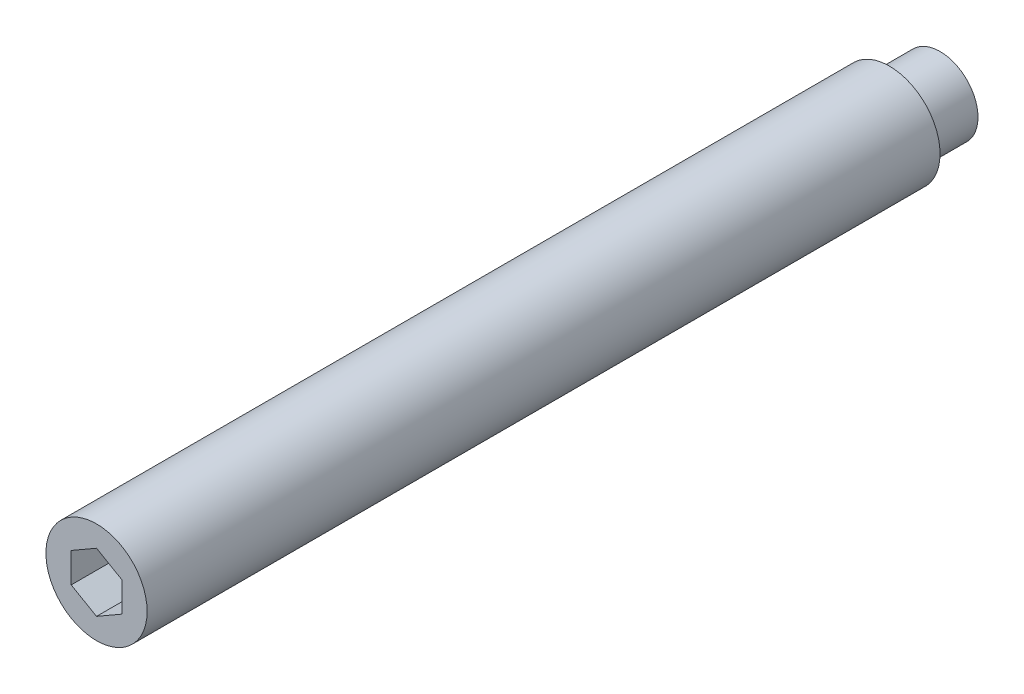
ISO-10303-21;
HEADER;
FILE_DESCRIPTION(('STEP AP214'),'2;1');
FILE_NAME('part.step','',(''),(''),'','','');
FILE_SCHEMA(('AUTOMOTIVE_DESIGN { 1 0 10303 214 1 1 1 1 }'));
ENDSEC;
DATA;
#1=APPLICATION_CONTEXT('core data for automotive mechanical design processes');
#2=APPLICATION_PROTOCOL_DEFINITION('international standard','automotive_design',2000,#1);
#3=PRODUCT_CONTEXT('',#1,'mechanical');
#4=PRODUCT('Part','Part','',(#3));
#5=PRODUCT_RELATED_PRODUCT_CATEGORY('part','',(#4));
#6=PRODUCT_DEFINITION_FORMATION('','',#4);
#7=PRODUCT_DEFINITION_CONTEXT('part definition',#1,'design');
#8=PRODUCT_DEFINITION('design','',#6,#7);
#9=PRODUCT_DEFINITION_SHAPE('','',#8);
#10=(LENGTH_UNIT() NAMED_UNIT(*) SI_UNIT(.MILLI.,.METRE.));
#11=(NAMED_UNIT(*) PLANE_ANGLE_UNIT() SI_UNIT($,.RADIAN.));
#12=(NAMED_UNIT(*) SI_UNIT($,.STERADIAN.) SOLID_ANGLE_UNIT());
#13=UNCERTAINTY_MEASURE_WITH_UNIT(LENGTH_MEASURE(1.E-05),#10,'distance_accuracy_value','');
#14=(GEOMETRIC_REPRESENTATION_CONTEXT(3) GLOBAL_UNCERTAINTY_ASSIGNED_CONTEXT((#13)) GLOBAL_UNIT_ASSIGNED_CONTEXT((#10,
#11,#12)) REPRESENTATION_CONTEXT('',''));
#15=CARTESIAN_POINT('',(0.,0.,0.));
#16=DIRECTION('',(0.,0.,1.));
#17=DIRECTION('',(1.,0.,0.));
#18=AXIS2_PLACEMENT_3D('',#15,#16,#17);
#19=CARTESIAN_POINT('',(0.,3.5,95.));
#20=DIRECTION('',(-0.5,-0.866025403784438,0.));
#21=DIRECTION('',(0.866025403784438,-0.5,0.));
#22=AXIS2_PLACEMENT_3D('',#19,#20,#21);
#23=PLANE('',#22);
#24=DIRECTION('',(0.,0.,1.));
#25=VECTOR('',#24,1.);
#26=CARTESIAN_POINT('',(3.,1.76794919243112,95.));
#27=LINE('',#26,#25);
#28=CARTESIAN_POINT('',(3.,1.76794919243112,95.));
#29=VERTEX_POINT('',#28);
#30=CARTESIAN_POINT('',(3.,1.76794919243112,100.));
#31=VERTEX_POINT('',#30);
#32=EDGE_CURVE('E37',#29,#31,#27,.T.);
#33=ORIENTED_EDGE('',*,*,#32,.T.);
#34=DIRECTION('',(0.866025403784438,-0.5,0.));
#35=VECTOR('',#34,1.);
#36=CARTESIAN_POINT('',(0.,3.5,100.));
#37=LINE('',#36,#35);
#38=CARTESIAN_POINT('',(0.,3.5,100.));
#39=VERTEX_POINT('',#38);
#40=EDGE_CURVE('E29',#39,#31,#37,.T.);
#41=ORIENTED_EDGE('',*,*,#40,.F.);
#42=DIRECTION('',(0.,0.,1.));
#43=VECTOR('',#42,1.);
#44=CARTESIAN_POINT('',(0.,3.5,95.));
#45=LINE('',#44,#43);
#46=CARTESIAN_POINT('',(0.,3.5,95.));
#47=VERTEX_POINT('',#46);
#48=EDGE_CURVE('E93',#47,#39,#45,.T.);
#49=ORIENTED_EDGE('',*,*,#48,.F.);
#50=DIRECTION('',(0.866025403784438,-0.5,0.));
#51=VECTOR('',#50,1.);
#52=CARTESIAN_POINT('',(0.,3.5,95.));
#53=LINE('',#52,#51);
#54=EDGE_CURVE('E96',#47,#29,#53,.T.);
#55=ORIENTED_EDGE('',*,*,#54,.T.);
#56=EDGE_LOOP('',(#33,#41,#49,#55));
#57=FACE_BOUND('',#56,.T.);
#58=ADVANCED_FACE('F14',(#57),#23,.T.);
#59=CARTESIAN_POINT('',(3.,1.76794919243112,95.));
#60=DIRECTION('',(-1.,0.,0.));
#61=DIRECTION('',(0.,-1.,0.));
#62=AXIS2_PLACEMENT_3D('',#59,#60,#61);
#63=PLANE('',#62);
#64=DIRECTION('',(0.,0.,1.));
#65=VECTOR('',#64,1.);
#66=CARTESIAN_POINT('',(3.,-1.76794919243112,95.));
#67=LINE('',#66,#65);
#68=CARTESIAN_POINT('',(3.,-1.76794919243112,95.));
#69=VERTEX_POINT('',#68);
#70=CARTESIAN_POINT('',(3.,-1.76794919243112,100.));
#71=VERTEX_POINT('',#70);
#72=EDGE_CURVE('E72',#69,#71,#67,.T.);
#73=ORIENTED_EDGE('',*,*,#72,.T.);
#74=DIRECTION('',(0.,-1.,0.));
#75=VECTOR('',#74,1.);
#76=CARTESIAN_POINT('',(3.,1.76794919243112,100.));
#77=LINE('',#76,#75);
#78=EDGE_CURVE('E234',#31,#71,#77,.T.);
#79=ORIENTED_EDGE('',*,*,#78,.F.);
#80=ORIENTED_EDGE('',*,*,#32,.F.);
#81=DIRECTION('',(0.,-1.,0.));
#82=VECTOR('',#81,1.);
#83=CARTESIAN_POINT('',(3.,1.76794919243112,95.));
#84=LINE('',#83,#82);
#85=EDGE_CURVE('E81',#29,#69,#84,.T.);
#86=ORIENTED_EDGE('',*,*,#85,.T.);
#87=EDGE_LOOP('',(#73,#79,#80,#86));
#88=FACE_BOUND('',#87,.T.);
#89=ADVANCED_FACE('F128',(#88),#63,.T.);
#90=CARTESIAN_POINT('',(0.,-3.5,95.));
#91=DIRECTION('',(0.5,-0.866025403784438,0.));
#92=DIRECTION('',(0.866025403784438,0.5,0.));
#93=AXIS2_PLACEMENT_3D('',#90,#91,#92);
#94=PLANE('',#93);
#95=DIRECTION('',(0.,0.,1.));
#96=VECTOR('',#95,1.);
#97=CARTESIAN_POINT('',(0.,-3.5,95.));
#98=LINE('',#97,#96);
#99=CARTESIAN_POINT('',(0.,-3.5,95.));
#100=VERTEX_POINT('',#99);
#101=CARTESIAN_POINT('',(0.,-3.5,100.));
#102=VERTEX_POINT('',#101);
#103=EDGE_CURVE('E59',#100,#102,#98,.T.);
#104=ORIENTED_EDGE('',*,*,#103,.T.);
#105=DIRECTION('',(0.866025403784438,0.5,0.));
#106=VECTOR('',#105,1.);
#107=CARTESIAN_POINT('',(0.,-3.5,100.));
#108=LINE('',#107,#106);
#109=EDGE_CURVE('E240',#102,#71,#108,.T.);
#110=ORIENTED_EDGE('',*,*,#109,.T.);
#111=ORIENTED_EDGE('',*,*,#72,.F.);
#112=DIRECTION('',(0.866025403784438,0.5,0.));
#113=VECTOR('',#112,1.);
#114=CARTESIAN_POINT('',(0.,-3.5,95.));
#115=LINE('',#114,#113);
#116=EDGE_CURVE('E76',#100,#69,#115,.T.);
#117=ORIENTED_EDGE('',*,*,#116,.F.);
#118=EDGE_LOOP('',(#104,#110,#111,#117));
#119=FACE_BOUND('',#118,.T.);
#120=ADVANCED_FACE('F77',(#119),#94,.F.);
#121=CARTESIAN_POINT('',(0.,-3.5,95.));
#122=DIRECTION('',(0.5,0.866025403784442,0.));
#123=DIRECTION('',(-0.866025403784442,0.5,0.));
#124=AXIS2_PLACEMENT_3D('',#121,#122,#123);
#125=PLANE('',#124);
#126=DIRECTION('',(0.,0.,1.));
#127=VECTOR('',#126,1.);
#128=CARTESIAN_POINT('',(-3.,-1.76794919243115,95.));
#129=LINE('',#128,#127);
#130=CARTESIAN_POINT('',(-3.,-1.76794919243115,95.));
#131=VERTEX_POINT('',#130);
#132=CARTESIAN_POINT('',(-3.,-1.76794919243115,100.));
#133=VERTEX_POINT('',#132);
#134=EDGE_CURVE('E73',#131,#133,#129,.T.);
#135=ORIENTED_EDGE('',*,*,#134,.T.);
#136=DIRECTION('',(-0.866025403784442,0.5,0.));
#137=VECTOR('',#136,1.);
#138=CARTESIAN_POINT('',(0.,-3.5,100.));
#139=LINE('',#138,#137);
#140=EDGE_CURVE('E68',#102,#133,#139,.T.);
#141=ORIENTED_EDGE('',*,*,#140,.F.);
#142=ORIENTED_EDGE('',*,*,#103,.F.);
#143=DIRECTION('',(-0.866025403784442,0.5,0.));
#144=VECTOR('',#143,1.);
#145=CARTESIAN_POINT('',(0.,-3.5,95.));
#146=LINE('',#145,#144);
#147=EDGE_CURVE('E64',#100,#131,#146,.T.);
#148=ORIENTED_EDGE('',*,*,#147,.T.);
#149=EDGE_LOOP('',(#135,#141,#142,#148));
#150=FACE_BOUND('',#149,.T.);
#151=ADVANCED_FACE('F62',(#150),#125,.T.);
#152=CARTESIAN_POINT('',(-3.,1.76794919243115,95.));
#153=DIRECTION('',(-1.,0.,0.));
#154=DIRECTION('',(0.,0.,1.));
#155=AXIS2_PLACEMENT_3D('',#152,#153,#154);
#156=PLANE('',#155);
#157=DIRECTION('',(0.,0.,1.));
#158=VECTOR('',#157,1.);
#159=CARTESIAN_POINT('',(-3.,1.76794919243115,95.));
#160=LINE('',#159,#158);
#161=CARTESIAN_POINT('',(-3.,1.76794919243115,95.));
#162=VERTEX_POINT('',#161);
#163=CARTESIAN_POINT('',(-3.,1.76794919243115,100.));
#164=VERTEX_POINT('',#163);
#165=EDGE_CURVE('E95',#162,#164,#160,.T.);
#166=ORIENTED_EDGE('',*,*,#165,.T.);
#167=DIRECTION('',(0.,-1.,0.));
#168=VECTOR('',#167,1.);
#169=CARTESIAN_POINT('',(-3.,1.76794919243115,100.));
#170=LINE('',#169,#168);
#171=EDGE_CURVE('E245',#164,#133,#170,.T.);
#172=ORIENTED_EDGE('',*,*,#171,.T.);
#173=ORIENTED_EDGE('',*,*,#134,.F.);
#174=DIRECTION('',(0.,-1.,0.));
#175=VECTOR('',#174,1.);
#176=CARTESIAN_POINT('',(-3.,1.76794919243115,95.));
#177=LINE('',#176,#175);
#178=EDGE_CURVE('E87',#162,#131,#177,.T.);
#179=ORIENTED_EDGE('',*,*,#178,.F.);
#180=EDGE_LOOP('',(#166,#172,#173,#179));
#181=FACE_BOUND('',#180,.T.);
#182=ADVANCED_FACE('F139',(#181),#156,.F.);
#183=CARTESIAN_POINT('',(0.,3.5,95.));
#184=DIRECTION('',(-0.499999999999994,0.866025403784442,0.));
#185=DIRECTION('',(-0.866025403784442,-0.499999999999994,0.));
#186=AXIS2_PLACEMENT_3D('',#183,#184,#185);
#187=PLANE('',#186);
#188=DIRECTION('',(-0.866025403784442,-0.499999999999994,0.));
#189=VECTOR('',#188,1.);
#190=CARTESIAN_POINT('',(0.,3.5,95.));
#191=LINE('',#190,#189);
#192=EDGE_CURVE('E89',#47,#162,#191,.T.);
#193=ORIENTED_EDGE('',*,*,#192,.F.);
#194=ORIENTED_EDGE('',*,*,#48,.T.);
#195=DIRECTION('',(-0.866025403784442,-0.499999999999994,0.));
#196=VECTOR('',#195,1.);
#197=CARTESIAN_POINT('',(0.,3.5,100.));
#198=LINE('',#197,#196);
#199=EDGE_CURVE('E237',#39,#164,#198,.T.);
#200=ORIENTED_EDGE('',*,*,#199,.T.);
#201=ORIENTED_EDGE('',*,*,#165,.F.);
#202=EDGE_LOOP('',(#193,#194,#200,#201));
#203=FACE_BOUND('',#202,.T.);
#204=ADVANCED_FACE('F126',(#203),#187,.F.);
#205=CARTESIAN_POINT('',(6.06217782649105,0.,95.));
#206=DIRECTION('',(0.,0.,1.));
#207=DIRECTION('',(1.,0.,0.));
#208=AXIS2_PLACEMENT_3D('',#205,#206,#207);
#209=PLANE('',#208);
#210=ORIENTED_EDGE('',*,*,#54,.F.);
#211=ORIENTED_EDGE('',*,*,#192,.T.);
#212=ORIENTED_EDGE('',*,*,#178,.T.);
#213=ORIENTED_EDGE('',*,*,#147,.F.);
#214=ORIENTED_EDGE('',*,*,#116,.T.);
#215=ORIENTED_EDGE('',*,*,#85,.F.);
#216=EDGE_LOOP('',(#210,#211,#212,#213,#214,#215));
#217=FACE_BOUND('',#216,.T.);
#218=ADVANCED_FACE('F84',(#217),#209,.T.);
#219=CARTESIAN_POINT('',(6.,0.,100.));
#220=DIRECTION('',(0.,0.,-1.));
#221=DIRECTION('',(-1.,0.,0.));
#222=AXIS2_PLACEMENT_3D('',#219,#220,#221);
#223=PLANE('',#222);
#224=CARTESIAN_POINT('',(0.,0.,100.));
#225=DIRECTION('',(0.,0.,1.));
#226=DIRECTION('',(1.,0.,0.));
#227=AXIS2_PLACEMENT_3D('',#224,#225,#226);
#228=CIRCLE('',#227,6.);
#229=CARTESIAN_POINT('',(6.,0.,100.));
#230=VERTEX_POINT('',#229);
#231=EDGE_CURVE('E102',#230,#230,#228,.T.);
#232=ORIENTED_EDGE('',*,*,#231,.T.);
#233=EDGE_LOOP('',(#232));
#234=FACE_BOUND('',#233,.T.);
#235=ORIENTED_EDGE('',*,*,#40,.T.);
#236=ORIENTED_EDGE('',*,*,#78,.T.);
#237=ORIENTED_EDGE('',*,*,#109,.F.);
#238=ORIENTED_EDGE('',*,*,#140,.T.);
#239=ORIENTED_EDGE('',*,*,#171,.F.);
#240=ORIENTED_EDGE('',*,*,#199,.F.);
#241=EDGE_LOOP('',(#235,#236,#237,#238,#239,#240));
#242=FACE_BOUND('',#241,.T.);
#243=ADVANCED_FACE('F118',(#234,#242),#223,.F.);
#244=CARTESIAN_POINT('',(0.,0.,0.));
#245=DIRECTION('',(0.,0.,1.));
#246=DIRECTION('',(1.,0.,0.));
#247=AXIS2_PLACEMENT_3D('',#244,#245,#246);
#248=PLANE('',#247);
#249=CARTESIAN_POINT('',(0.,0.,0.));
#250=DIRECTION('',(0.,0.,1.));
#251=DIRECTION('',(1.,0.,0.));
#252=AXIS2_PLACEMENT_3D('',#249,#250,#251);
#253=CIRCLE('',#252,4.5);
#254=CARTESIAN_POINT('',(4.5,0.,0.));
#255=VERTEX_POINT('',#254);
#256=EDGE_CURVE('E9',#255,#255,#253,.T.);
#257=ORIENTED_EDGE('',*,*,#256,.F.);
#258=EDGE_LOOP('',(#257));
#259=FACE_BOUND('',#258,.T.);
#260=ADVANCED_FACE('F16',(#259),#248,.F.);
#261=CARTESIAN_POINT('',(0.,0.,110.));
#262=DIRECTION('',(0.,0.,1.));
#263=DIRECTION('',(1.,0.,0.));
#264=AXIS2_PLACEMENT_3D('',#261,#262,#263);
#265=CYLINDRICAL_SURFACE('',#264,4.5);
#266=CARTESIAN_POINT('',(0.,0.,6.));
#267=DIRECTION('',(0.,0.,1.));
#268=DIRECTION('',(1.,0.,0.));
#269=AXIS2_PLACEMENT_3D('',#266,#267,#268);
#270=CIRCLE('',#269,4.5);
#271=CARTESIAN_POINT('',(4.5,0.,6.));
#272=VERTEX_POINT('',#271);
#273=EDGE_CURVE('E22',#272,#272,#270,.T.);
#274=ORIENTED_EDGE('',*,*,#273,.F.);
#275=EDGE_LOOP('',(#274));
#276=FACE_BOUND('',#275,.T.);
#277=ORIENTED_EDGE('',*,*,#256,.T.);
#278=EDGE_LOOP('',(#277));
#279=FACE_BOUND('',#278,.T.);
#280=ADVANCED_FACE('F112',(#276,#279),#265,.T.);
#281=CARTESIAN_POINT('',(4.5,0.,6.));
#282=DIRECTION('',(0.,0.,1.));
#283=DIRECTION('',(1.,0.,0.));
#284=AXIS2_PLACEMENT_3D('',#281,#282,#283);
#285=PLANE('',#284);
#286=CARTESIAN_POINT('',(0.,0.,6.));
#287=DIRECTION('',(0.,0.,1.));
#288=DIRECTION('',(1.,0.,0.));
#289=AXIS2_PLACEMENT_3D('',#286,#287,#288);
#290=CIRCLE('',#289,6.);
#291=CARTESIAN_POINT('',(6.,0.,6.));
#292=VERTEX_POINT('',#291);
#293=EDGE_CURVE('E105',#292,#292,#290,.T.);
#294=ORIENTED_EDGE('',*,*,#293,.F.);
#295=EDGE_LOOP('',(#294));
#296=FACE_BOUND('',#295,.T.);
#297=ORIENTED_EDGE('',*,*,#273,.T.);
#298=EDGE_LOOP('',(#297));
#299=FACE_BOUND('',#298,.T.);
#300=ADVANCED_FACE('F110',(#296,#299),#285,.F.);
#301=CARTESIAN_POINT('',(0.,0.,110.));
#302=DIRECTION('',(0.,0.,1.));
#303=DIRECTION('',(1.,0.,0.));
#304=AXIS2_PLACEMENT_3D('',#301,#302,#303);
#305=CYLINDRICAL_SURFACE('',#304,6.);
#306=ORIENTED_EDGE('',*,*,#231,.F.);
#307=EDGE_LOOP('',(#306));
#308=FACE_BOUND('',#307,.T.);
#309=ORIENTED_EDGE('',*,*,#293,.T.);
#310=EDGE_LOOP('',(#309));
#311=FACE_BOUND('',#310,.T.);
#312=ADVANCED_FACE('F148',(#308,#311),#305,.T.);
#313=CLOSED_SHELL('',(#58,#89,#120,#151,#182,#204,#218,#243,#260,#280,#300,#312));
#314=MANIFOLD_SOLID_BREP('B1',#313);
#315=ADVANCED_BREP_SHAPE_REPRESENTATION('',(#18,#314),#14);
#316=SHAPE_DEFINITION_REPRESENTATION(#9,#315);
ENDSEC;
END-ISO-10303-21;
